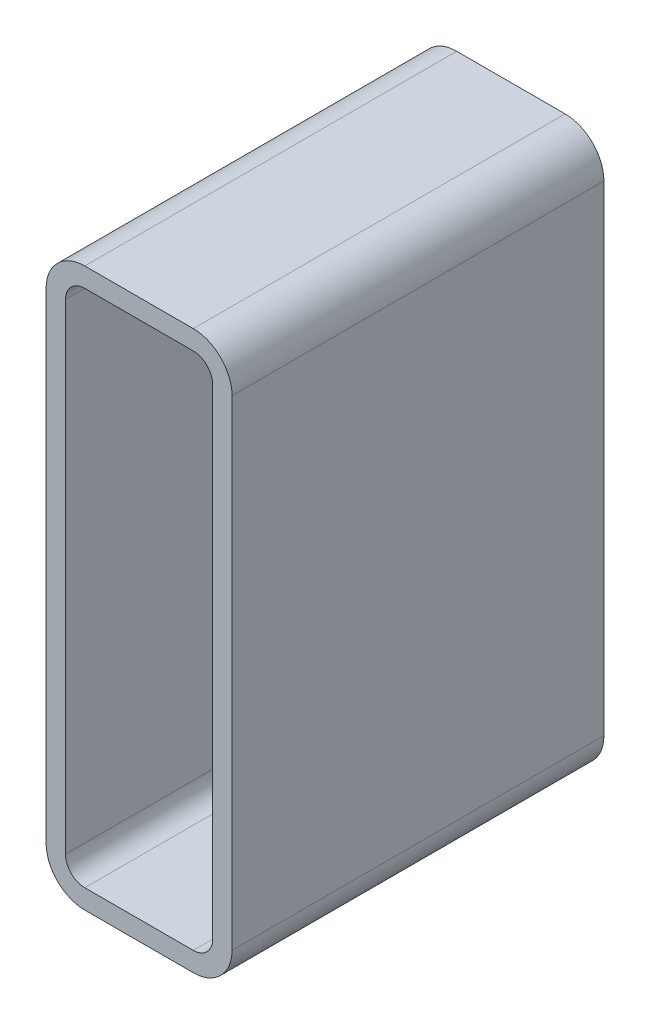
ISO-10303-21;
HEADER;
FILE_DESCRIPTION(('STEP AP214'),'2;1');
FILE_NAME('part.step','',(''),(''),'','','');
FILE_SCHEMA(('AUTOMOTIVE_DESIGN { 1 0 10303 214 1 1 1 1 }'));
ENDSEC;
DATA;
#1=APPLICATION_CONTEXT('core data for automotive mechanical design processes');
#2=APPLICATION_PROTOCOL_DEFINITION('international standard','automotive_design',2000,#1);
#3=PRODUCT_CONTEXT('',#1,'mechanical');
#4=PRODUCT('Part','Part','',(#3));
#5=PRODUCT_RELATED_PRODUCT_CATEGORY('part','',(#4));
#6=PRODUCT_DEFINITION_FORMATION('','',#4);
#7=PRODUCT_DEFINITION_CONTEXT('part definition',#1,'design');
#8=PRODUCT_DEFINITION('design','',#6,#7);
#9=PRODUCT_DEFINITION_SHAPE('','',#8);
#10=(LENGTH_UNIT() NAMED_UNIT(*) SI_UNIT(.MILLI.,.METRE.));
#11=(NAMED_UNIT(*) PLANE_ANGLE_UNIT() SI_UNIT($,.RADIAN.));
#12=(NAMED_UNIT(*) SI_UNIT($,.STERADIAN.) SOLID_ANGLE_UNIT());
#13=UNCERTAINTY_MEASURE_WITH_UNIT(LENGTH_MEASURE(1.E-05),#10,'distance_accuracy_value','');
#14=(GEOMETRIC_REPRESENTATION_CONTEXT(3) GLOBAL_UNCERTAINTY_ASSIGNED_CONTEXT((#13)) GLOBAL_UNIT_ASSIGNED_CONTEXT((#10,
#11,#12)) REPRESENTATION_CONTEXT('',''));
#15=CARTESIAN_POINT('',(0.,0.,0.));
#16=DIRECTION('',(0.,0.,1.));
#17=DIRECTION('',(1.,0.,0.));
#18=AXIS2_PLACEMENT_3D('',#15,#16,#17);
#19=CARTESIAN_POINT('',(31.7973013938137,427.187045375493,304.8));
#20=DIRECTION('',(0.,0.,1.));
#21=DIRECTION('',(1.,0.,0.));
#22=AXIS2_PLACEMENT_3D('',#19,#20,#21);
#23=PLANE('',#22);
#24=CARTESIAN_POINT('',(31.7973013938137,427.187045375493,304.8));
#25=DIRECTION('',(0.,0.,1.));
#26=DIRECTION('',(1.,0.,0.));
#27=AXIS2_PLACEMENT_3D('',#24,#25,#26);
#28=CIRCLE('',#27,31.75);
#29=CARTESIAN_POINT('',(31.7973013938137,458.937045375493,304.8));
#30=VERTEX_POINT('',#29);
#31=CARTESIAN_POINT('',(0.0473013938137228,427.187045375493,304.8));
#32=VERTEX_POINT('',#31);
#33=EDGE_CURVE('E211',#30,#32,#28,.T.);
#34=ORIENTED_EDGE('',*,*,#33,.T.);
#35=DIRECTION('',(0.,-1.,0.));
#36=VECTOR('',#35,1.);
#37=CARTESIAN_POINT('',(0.0473013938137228,427.187045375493,304.8));
#38=LINE('',#37,#36);
#39=CARTESIAN_POINT('',(0.0473013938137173,33.4870453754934,304.8));
#40=VERTEX_POINT('',#39);
#41=EDGE_CURVE('E214',#32,#40,#38,.T.);
#42=ORIENTED_EDGE('',*,*,#41,.T.);
#43=CARTESIAN_POINT('',(31.7973013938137,33.4870453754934,304.8));
#44=DIRECTION('',(0.,0.,1.));
#45=DIRECTION('',(1.,0.,0.));
#46=AXIS2_PLACEMENT_3D('',#43,#44,#45);
#47=CIRCLE('',#46,31.75);
#48=CARTESIAN_POINT('',(31.7973013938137,1.73704537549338,304.8));
#49=VERTEX_POINT('',#48);
#50=EDGE_CURVE('E217',#40,#49,#47,.T.);
#51=ORIENTED_EDGE('',*,*,#50,.T.);
#52=DIRECTION('',(1.,0.,0.));
#53=VECTOR('',#52,1.);
#54=CARTESIAN_POINT('',(31.7973013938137,1.73704537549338,304.8));
#55=LINE('',#54,#53);
#56=CARTESIAN_POINT('',(120.697301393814,1.73704537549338,304.8));
#57=VERTEX_POINT('',#56);
#58=EDGE_CURVE('E219',#49,#57,#55,.T.);
#59=ORIENTED_EDGE('',*,*,#58,.T.);
#60=CARTESIAN_POINT('',(120.697301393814,33.4870453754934,304.8));
#61=DIRECTION('',(0.,0.,1.));
#62=DIRECTION('',(1.,0.,0.));
#63=AXIS2_PLACEMENT_3D('',#60,#61,#62);
#64=CIRCLE('',#63,31.75);
#65=CARTESIAN_POINT('',(152.447301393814,33.4870453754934,304.8));
#66=VERTEX_POINT('',#65);
#67=EDGE_CURVE('E221',#57,#66,#64,.T.);
#68=ORIENTED_EDGE('',*,*,#67,.T.);
#69=DIRECTION('',(0.,1.,0.));
#70=VECTOR('',#69,1.);
#71=CARTESIAN_POINT('',(152.447301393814,33.4870453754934,304.8));
#72=LINE('',#71,#70);
#73=CARTESIAN_POINT('',(152.447301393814,427.187045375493,304.8));
#74=VERTEX_POINT('',#73);
#75=EDGE_CURVE('E223',#66,#74,#72,.T.);
#76=ORIENTED_EDGE('',*,*,#75,.T.);
#77=CARTESIAN_POINT('',(120.697301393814,427.187045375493,304.8));
#78=DIRECTION('',(0.,0.,1.));
#79=DIRECTION('',(1.,0.,0.));
#80=AXIS2_PLACEMENT_3D('',#77,#78,#79);
#81=CIRCLE('',#80,31.75);
#82=CARTESIAN_POINT('',(120.697301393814,458.937045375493,304.8));
#83=VERTEX_POINT('',#82);
#84=EDGE_CURVE('E225',#74,#83,#81,.T.);
#85=ORIENTED_EDGE('',*,*,#84,.T.);
#86=DIRECTION('',(-1.,0.,0.));
#87=VECTOR('',#86,1.);
#88=CARTESIAN_POINT('',(120.697301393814,458.937045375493,304.8));
#89=LINE('',#88,#87);
#90=EDGE_CURVE('E227',#83,#30,#89,.T.);
#91=ORIENTED_EDGE('',*,*,#90,.T.);
#92=EDGE_LOOP('',(#34,#42,#51,#59,#68,#76,#85,#91));
#93=FACE_BOUND('',#92,.T.);
#94=DIRECTION('',(0.,-1.,0.));
#95=VECTOR('',#94,1.);
#96=CARTESIAN_POINT('',(15.9223013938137,33.4870453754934,304.8));
#97=LINE('',#96,#95);
#98=CARTESIAN_POINT('',(15.9223013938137,427.187045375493,304.8));
#99=VERTEX_POINT('',#98);
#100=CARTESIAN_POINT('',(15.9223013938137,33.4870453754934,304.8));
#101=VERTEX_POINT('',#100);
#102=EDGE_CURVE('E154',#99,#101,#97,.T.);
#103=ORIENTED_EDGE('',*,*,#102,.F.);
#104=CARTESIAN_POINT('',(31.7973013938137,427.187045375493,304.8));
#105=DIRECTION('',(0.,0.,1.));
#106=DIRECTION('',(1.,0.,0.));
#107=AXIS2_PLACEMENT_3D('',#104,#105,#106);
#108=CIRCLE('',#107,15.875);
#109=CARTESIAN_POINT('',(31.7973013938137,443.062045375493,304.8));
#110=VERTEX_POINT('',#109);
#111=EDGE_CURVE('E146',#110,#99,#108,.T.);
#112=ORIENTED_EDGE('',*,*,#111,.F.);
#113=DIRECTION('',(-1.,0.,0.));
#114=VECTOR('',#113,1.);
#115=CARTESIAN_POINT('',(31.7973013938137,443.062045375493,304.8));
#116=LINE('',#115,#114);
#117=CARTESIAN_POINT('',(120.697301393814,443.062045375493,304.8));
#118=VERTEX_POINT('',#117);
#119=EDGE_CURVE('E179',#118,#110,#116,.T.);
#120=ORIENTED_EDGE('',*,*,#119,.F.);
#121=CARTESIAN_POINT('',(120.697301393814,427.187045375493,304.8));
#122=DIRECTION('',(0.,0.,1.));
#123=DIRECTION('',(1.,0.,0.));
#124=AXIS2_PLACEMENT_3D('',#121,#122,#123);
#125=CIRCLE('',#124,15.875);
#126=CARTESIAN_POINT('',(136.572301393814,427.187045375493,304.8));
#127=VERTEX_POINT('',#126);
#128=EDGE_CURVE('E177',#127,#118,#125,.T.);
#129=ORIENTED_EDGE('',*,*,#128,.F.);
#130=DIRECTION('',(0.,1.,0.));
#131=VECTOR('',#130,1.);
#132=CARTESIAN_POINT('',(136.572301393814,427.187045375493,304.8));
#133=LINE('',#132,#131);
#134=CARTESIAN_POINT('',(136.572301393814,33.4870453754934,304.8));
#135=VERTEX_POINT('',#134);
#136=EDGE_CURVE('E175',#135,#127,#133,.T.);
#137=ORIENTED_EDGE('',*,*,#136,.F.);
#138=CARTESIAN_POINT('',(120.697301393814,33.4870453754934,304.8));
#139=DIRECTION('',(0.,0.,1.));
#140=DIRECTION('',(1.,0.,0.));
#141=AXIS2_PLACEMENT_3D('',#138,#139,#140);
#142=CIRCLE('',#141,15.875);
#143=CARTESIAN_POINT('',(120.697301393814,17.6120453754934,304.8));
#144=VERTEX_POINT('',#143);
#145=EDGE_CURVE('E173',#144,#135,#142,.T.);
#146=ORIENTED_EDGE('',*,*,#145,.F.);
#147=DIRECTION('',(1.,0.,0.));
#148=VECTOR('',#147,1.);
#149=CARTESIAN_POINT('',(120.697301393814,17.6120453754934,304.8));
#150=LINE('',#149,#148);
#151=CARTESIAN_POINT('',(31.7973013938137,17.6120453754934,304.8));
#152=VERTEX_POINT('',#151);
#153=EDGE_CURVE('E169',#152,#144,#150,.T.);
#154=ORIENTED_EDGE('',*,*,#153,.F.);
#155=CARTESIAN_POINT('',(31.7973013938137,33.4870453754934,304.8));
#156=DIRECTION('',(0.,0.,1.));
#157=DIRECTION('',(1.,0.,0.));
#158=AXIS2_PLACEMENT_3D('',#155,#156,#157);
#159=CIRCLE('',#158,15.875);
#160=EDGE_CURVE('E167',#101,#152,#159,.T.);
#161=ORIENTED_EDGE('',*,*,#160,.F.);
#162=EDGE_LOOP('',(#103,#112,#120,#129,#137,#146,#154,#161));
#163=FACE_BOUND('',#162,.T.);
#164=ADVANCED_FACE('F33',(#93,#163),#23,.T.);
#165=CARTESIAN_POINT('',(31.7973013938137,427.187045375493,0.));
#166=DIRECTION('',(0.,0.,1.));
#167=DIRECTION('',(1.,0.,0.));
#168=AXIS2_PLACEMENT_3D('',#165,#166,#167);
#169=PLANE('',#168);
#170=CARTESIAN_POINT('',(31.7973013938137,427.187045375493,0.));
#171=DIRECTION('',(0.,0.,1.));
#172=DIRECTION('',(1.,0.,0.));
#173=AXIS2_PLACEMENT_3D('',#170,#171,#172);
#174=CIRCLE('',#173,31.75);
#175=CARTESIAN_POINT('',(31.7973013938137,458.937045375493,0.));
#176=VERTEX_POINT('',#175);
#177=CARTESIAN_POINT('',(0.0473013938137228,427.187045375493,0.));
#178=VERTEX_POINT('',#177);
#179=EDGE_CURVE('E162',#176,#178,#174,.T.);
#180=ORIENTED_EDGE('',*,*,#179,.F.);
#181=DIRECTION('',(-1.,0.,0.));
#182=VECTOR('',#181,1.);
#183=CARTESIAN_POINT('',(120.697301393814,458.937045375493,0.));
#184=LINE('',#183,#182);
#185=CARTESIAN_POINT('',(120.697301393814,458.937045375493,0.));
#186=VERTEX_POINT('',#185);
#187=EDGE_CURVE('E215',#186,#176,#184,.T.);
#188=ORIENTED_EDGE('',*,*,#187,.F.);
#189=CARTESIAN_POINT('',(120.697301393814,427.187045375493,0.));
#190=DIRECTION('',(0.,0.,1.));
#191=DIRECTION('',(1.,0.,0.));
#192=AXIS2_PLACEMENT_3D('',#189,#190,#191);
#193=CIRCLE('',#192,31.75);
#194=CARTESIAN_POINT('',(152.447301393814,427.187045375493,0.));
#195=VERTEX_POINT('',#194);
#196=EDGE_CURVE('E242',#195,#186,#193,.T.);
#197=ORIENTED_EDGE('',*,*,#196,.F.);
#198=DIRECTION('',(0.,1.,0.));
#199=VECTOR('',#198,1.);
#200=CARTESIAN_POINT('',(152.447301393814,33.4870453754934,0.));
#201=LINE('',#200,#199);
#202=CARTESIAN_POINT('',(152.447301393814,33.4870453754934,0.));
#203=VERTEX_POINT('',#202);
#204=EDGE_CURVE('E240',#203,#195,#201,.T.);
#205=ORIENTED_EDGE('',*,*,#204,.F.);
#206=CARTESIAN_POINT('',(120.697301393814,33.4870453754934,0.));
#207=DIRECTION('',(0.,0.,1.));
#208=DIRECTION('',(1.,0.,0.));
#209=AXIS2_PLACEMENT_3D('',#206,#207,#208);
#210=CIRCLE('',#209,31.75);
#211=CARTESIAN_POINT('',(120.697301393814,1.73704537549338,0.));
#212=VERTEX_POINT('',#211);
#213=EDGE_CURVE('E238',#212,#203,#210,.T.);
#214=ORIENTED_EDGE('',*,*,#213,.F.);
#215=DIRECTION('',(1.,0.,0.));
#216=VECTOR('',#215,1.);
#217=CARTESIAN_POINT('',(31.7973013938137,1.73704537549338,0.));
#218=LINE('',#217,#216);
#219=CARTESIAN_POINT('',(31.7973013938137,1.73704537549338,0.));
#220=VERTEX_POINT('',#219);
#221=EDGE_CURVE('E236',#220,#212,#218,.T.);
#222=ORIENTED_EDGE('',*,*,#221,.F.);
#223=CARTESIAN_POINT('',(31.7973013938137,33.4870453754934,0.));
#224=DIRECTION('',(0.,0.,1.));
#225=DIRECTION('',(1.,0.,0.));
#226=AXIS2_PLACEMENT_3D('',#223,#224,#225);
#227=CIRCLE('',#226,31.75);
#228=CARTESIAN_POINT('',(0.0473013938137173,33.4870453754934,0.));
#229=VERTEX_POINT('',#228);
#230=EDGE_CURVE('E234',#229,#220,#227,.T.);
#231=ORIENTED_EDGE('',*,*,#230,.F.);
#232=DIRECTION('',(0.,-1.,0.));
#233=VECTOR('',#232,1.);
#234=CARTESIAN_POINT('',(0.0473013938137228,427.187045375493,0.));
#235=LINE('',#234,#233);
#236=EDGE_CURVE('E232',#178,#229,#235,.T.);
#237=ORIENTED_EDGE('',*,*,#236,.F.);
#238=EDGE_LOOP('',(#180,#188,#197,#205,#214,#222,#231,#237));
#239=FACE_BOUND('',#238,.T.);
#240=CARTESIAN_POINT('',(31.7973013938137,427.187045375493,0.));
#241=DIRECTION('',(0.,0.,1.));
#242=DIRECTION('',(1.,0.,0.));
#243=AXIS2_PLACEMENT_3D('',#240,#241,#242);
#244=CIRCLE('',#243,15.875);
#245=CARTESIAN_POINT('',(31.7973013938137,443.062045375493,0.));
#246=VERTEX_POINT('',#245);
#247=CARTESIAN_POINT('',(15.9223013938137,427.187045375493,0.));
#248=VERTEX_POINT('',#247);
#249=EDGE_CURVE('E56',#246,#248,#244,.T.);
#250=ORIENTED_EDGE('',*,*,#249,.T.);
#251=DIRECTION('',(0.,-1.,0.));
#252=VECTOR('',#251,1.);
#253=CARTESIAN_POINT('',(15.9223013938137,33.4870453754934,0.));
#254=LINE('',#253,#252);
#255=CARTESIAN_POINT('',(15.9223013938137,33.4870453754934,0.));
#256=VERTEX_POINT('',#255);
#257=EDGE_CURVE('E161',#248,#256,#254,.T.);
#258=ORIENTED_EDGE('',*,*,#257,.T.);
#259=CARTESIAN_POINT('',(31.7973013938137,33.4870453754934,0.));
#260=DIRECTION('',(0.,0.,1.));
#261=DIRECTION('',(1.,0.,0.));
#262=AXIS2_PLACEMENT_3D('',#259,#260,#261);
#263=CIRCLE('',#262,15.875);
#264=CARTESIAN_POINT('',(31.7973013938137,17.6120453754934,0.));
#265=VERTEX_POINT('',#264);
#266=EDGE_CURVE('E183',#256,#265,#263,.T.);
#267=ORIENTED_EDGE('',*,*,#266,.T.);
#268=DIRECTION('',(1.,0.,0.));
#269=VECTOR('',#268,1.);
#270=CARTESIAN_POINT('',(120.697301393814,17.6120453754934,0.));
#271=LINE('',#270,#269);
#272=CARTESIAN_POINT('',(120.697301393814,17.6120453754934,0.));
#273=VERTEX_POINT('',#272);
#274=EDGE_CURVE('E186',#265,#273,#271,.T.);
#275=ORIENTED_EDGE('',*,*,#274,.T.);
#276=CARTESIAN_POINT('',(120.697301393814,33.4870453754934,0.));
#277=DIRECTION('',(0.,0.,1.));
#278=DIRECTION('',(1.,0.,0.));
#279=AXIS2_PLACEMENT_3D('',#276,#277,#278);
#280=CIRCLE('',#279,15.875);
#281=CARTESIAN_POINT('',(136.572301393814,33.4870453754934,0.));
#282=VERTEX_POINT('',#281);
#283=EDGE_CURVE('E189',#273,#282,#280,.T.);
#284=ORIENTED_EDGE('',*,*,#283,.T.);
#285=DIRECTION('',(0.,1.,0.));
#286=VECTOR('',#285,1.);
#287=CARTESIAN_POINT('',(136.572301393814,427.187045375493,0.));
#288=LINE('',#287,#286);
#289=CARTESIAN_POINT('',(136.572301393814,427.187045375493,0.));
#290=VERTEX_POINT('',#289);
#291=EDGE_CURVE('E192',#282,#290,#288,.T.);
#292=ORIENTED_EDGE('',*,*,#291,.T.);
#293=CARTESIAN_POINT('',(120.697301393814,427.187045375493,0.));
#294=DIRECTION('',(0.,0.,1.));
#295=DIRECTION('',(1.,0.,0.));
#296=AXIS2_PLACEMENT_3D('',#293,#294,#295);
#297=CIRCLE('',#296,15.875);
#298=CARTESIAN_POINT('',(120.697301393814,443.062045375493,0.));
#299=VERTEX_POINT('',#298);
#300=EDGE_CURVE('E195',#290,#299,#297,.T.);
#301=ORIENTED_EDGE('',*,*,#300,.T.);
#302=DIRECTION('',(-1.,0.,0.));
#303=VECTOR('',#302,1.);
#304=CARTESIAN_POINT('',(31.7973013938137,443.062045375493,0.));
#305=LINE('',#304,#303);
#306=EDGE_CURVE('E155',#299,#246,#305,.T.);
#307=ORIENTED_EDGE('',*,*,#306,.T.);
#308=EDGE_LOOP('',(#250,#258,#267,#275,#284,#292,#301,#307));
#309=FACE_BOUND('',#308,.T.);
#310=ADVANCED_FACE('F272',(#239,#309),#169,.F.);
#311=CARTESIAN_POINT('',(31.7973013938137,427.187045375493,304.8));
#312=DIRECTION('',(0.,0.,-1.));
#313=DIRECTION('',(-1.,0.,0.));
#314=AXIS2_PLACEMENT_3D('',#311,#312,#313);
#315=CYLINDRICAL_SURFACE('',#314,31.75);
#316=ORIENTED_EDGE('',*,*,#179,.T.);
#317=DIRECTION('',(0.,0.,-1.));
#318=VECTOR('',#317,1.);
#319=CARTESIAN_POINT('',(0.0473013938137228,427.187045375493,304.8));
#320=LINE('',#319,#318);
#321=EDGE_CURVE('E11',#32,#178,#320,.T.);
#322=ORIENTED_EDGE('',*,*,#321,.F.);
#323=ORIENTED_EDGE('',*,*,#33,.F.);
#324=DIRECTION('',(0.,0.,-1.));
#325=VECTOR('',#324,1.);
#326=CARTESIAN_POINT('',(31.7973013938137,458.937045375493,304.8));
#327=LINE('',#326,#325);
#328=EDGE_CURVE('E229',#30,#176,#327,.T.);
#329=ORIENTED_EDGE('',*,*,#328,.T.);
#330=EDGE_LOOP('',(#316,#322,#323,#329));
#331=FACE_BOUND('',#330,.T.);
#332=ADVANCED_FACE('F35',(#331),#315,.T.);
#333=CARTESIAN_POINT('',(0.0473013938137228,427.187045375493,304.8));
#334=DIRECTION('',(1.,0.,0.));
#335=DIRECTION('',(0.,0.,-1.));
#336=AXIS2_PLACEMENT_3D('',#333,#334,#335);
#337=PLANE('',#336);
#338=ORIENTED_EDGE('',*,*,#236,.T.);
#339=DIRECTION('',(0.,0.,-1.));
#340=VECTOR('',#339,1.);
#341=CARTESIAN_POINT('',(0.0473013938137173,33.4870453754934,304.8));
#342=LINE('',#341,#340);
#343=EDGE_CURVE('E41',#40,#229,#342,.T.);
#344=ORIENTED_EDGE('',*,*,#343,.F.);
#345=ORIENTED_EDGE('',*,*,#41,.F.);
#346=ORIENTED_EDGE('',*,*,#321,.T.);
#347=EDGE_LOOP('',(#338,#344,#345,#346));
#348=FACE_BOUND('',#347,.T.);
#349=ADVANCED_FACE('F289',(#348),#337,.F.);
#350=CARTESIAN_POINT('',(31.7973013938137,33.4870453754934,304.8));
#351=DIRECTION('',(0.,0.,-1.));
#352=DIRECTION('',(-1.,0.,0.));
#353=AXIS2_PLACEMENT_3D('',#350,#351,#352);
#354=CYLINDRICAL_SURFACE('',#353,31.75);
#355=ORIENTED_EDGE('',*,*,#230,.T.);
#356=DIRECTION('',(0.,0.,-1.));
#357=VECTOR('',#356,1.);
#358=CARTESIAN_POINT('',(31.7973013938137,1.73704537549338,304.8));
#359=LINE('',#358,#357);
#360=EDGE_CURVE('E259',#49,#220,#359,.T.);
#361=ORIENTED_EDGE('',*,*,#360,.F.);
#362=ORIENTED_EDGE('',*,*,#50,.F.);
#363=ORIENTED_EDGE('',*,*,#343,.T.);
#364=EDGE_LOOP('',(#355,#361,#362,#363));
#365=FACE_BOUND('',#364,.T.);
#366=ADVANCED_FACE('F266',(#365),#354,.T.);
#367=CARTESIAN_POINT('',(31.7973013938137,1.73704537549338,304.8));
#368=DIRECTION('',(0.,1.,0.));
#369=DIRECTION('',(0.,0.,1.));
#370=AXIS2_PLACEMENT_3D('',#367,#368,#369);
#371=PLANE('',#370);
#372=ORIENTED_EDGE('',*,*,#221,.T.);
#373=DIRECTION('',(0.,0.,-1.));
#374=VECTOR('',#373,1.);
#375=CARTESIAN_POINT('',(120.697301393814,1.73704537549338,304.8));
#376=LINE('',#375,#374);
#377=EDGE_CURVE('E256',#57,#212,#376,.T.);
#378=ORIENTED_EDGE('',*,*,#377,.F.);
#379=ORIENTED_EDGE('',*,*,#58,.F.);
#380=ORIENTED_EDGE('',*,*,#360,.T.);
#381=EDGE_LOOP('',(#372,#378,#379,#380));
#382=FACE_BOUND('',#381,.T.);
#383=ADVANCED_FACE('F278',(#382),#371,.F.);
#384=CARTESIAN_POINT('',(120.697301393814,33.4870453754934,304.8));
#385=DIRECTION('',(0.,0.,-1.));
#386=DIRECTION('',(-1.,0.,0.));
#387=AXIS2_PLACEMENT_3D('',#384,#385,#386);
#388=CYLINDRICAL_SURFACE('',#387,31.75);
#389=ORIENTED_EDGE('',*,*,#213,.T.);
#390=DIRECTION('',(0.,0.,-1.));
#391=VECTOR('',#390,1.);
#392=CARTESIAN_POINT('',(152.447301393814,33.4870453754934,304.8));
#393=LINE('',#392,#391);
#394=EDGE_CURVE('E253',#66,#203,#393,.T.);
#395=ORIENTED_EDGE('',*,*,#394,.F.);
#396=ORIENTED_EDGE('',*,*,#67,.F.);
#397=ORIENTED_EDGE('',*,*,#377,.T.);
#398=EDGE_LOOP('',(#389,#395,#396,#397));
#399=FACE_BOUND('',#398,.T.);
#400=ADVANCED_FACE('F282',(#399),#388,.T.);
#401=CARTESIAN_POINT('',(152.447301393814,33.4870453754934,304.8));
#402=DIRECTION('',(-1.,0.,0.));
#403=DIRECTION('',(0.,0.,1.));
#404=AXIS2_PLACEMENT_3D('',#401,#402,#403);
#405=PLANE('',#404);
#406=ORIENTED_EDGE('',*,*,#204,.T.);
#407=DIRECTION('',(0.,0.,-1.));
#408=VECTOR('',#407,1.);
#409=CARTESIAN_POINT('',(152.447301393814,427.187045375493,304.8));
#410=LINE('',#409,#408);
#411=EDGE_CURVE('E250',#74,#195,#410,.T.);
#412=ORIENTED_EDGE('',*,*,#411,.F.);
#413=ORIENTED_EDGE('',*,*,#75,.F.);
#414=ORIENTED_EDGE('',*,*,#394,.T.);
#415=EDGE_LOOP('',(#406,#412,#413,#414));
#416=FACE_BOUND('',#415,.T.);
#417=ADVANCED_FACE('F302',(#416),#405,.F.);
#418=CARTESIAN_POINT('',(120.697301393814,427.187045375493,304.8));
#419=DIRECTION('',(0.,0.,-1.));
#420=DIRECTION('',(-1.,0.,0.));
#421=AXIS2_PLACEMENT_3D('',#418,#419,#420);
#422=CYLINDRICAL_SURFACE('',#421,31.75);
#423=ORIENTED_EDGE('',*,*,#196,.T.);
#424=DIRECTION('',(0.,0.,-1.));
#425=VECTOR('',#424,1.);
#426=CARTESIAN_POINT('',(120.697301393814,458.937045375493,304.8));
#427=LINE('',#426,#425);
#428=EDGE_CURVE('E247',#83,#186,#427,.T.);
#429=ORIENTED_EDGE('',*,*,#428,.F.);
#430=ORIENTED_EDGE('',*,*,#84,.F.);
#431=ORIENTED_EDGE('',*,*,#411,.T.);
#432=EDGE_LOOP('',(#423,#429,#430,#431));
#433=FACE_BOUND('',#432,.T.);
#434=ADVANCED_FACE('F300',(#433),#422,.T.);
#435=CARTESIAN_POINT('',(120.697301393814,458.937045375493,304.8));
#436=DIRECTION('',(0.,-1.,0.));
#437=DIRECTION('',(0.,0.,-1.));
#438=AXIS2_PLACEMENT_3D('',#435,#436,#437);
#439=PLANE('',#438);
#440=ORIENTED_EDGE('',*,*,#187,.T.);
#441=ORIENTED_EDGE('',*,*,#328,.F.);
#442=ORIENTED_EDGE('',*,*,#90,.F.);
#443=ORIENTED_EDGE('',*,*,#428,.T.);
#444=EDGE_LOOP('',(#440,#441,#442,#443));
#445=FACE_BOUND('',#444,.T.);
#446=ADVANCED_FACE('F295',(#445),#439,.F.);
#447=CARTESIAN_POINT('',(31.7973013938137,427.187045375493,304.8));
#448=DIRECTION('',(0.,0.,-1.));
#449=DIRECTION('',(-1.,0.,0.));
#450=AXIS2_PLACEMENT_3D('',#447,#448,#449);
#451=CYLINDRICAL_SURFACE('',#450,15.875);
#452=ORIENTED_EDGE('',*,*,#249,.F.);
#453=DIRECTION('',(0.,0.,-1.));
#454=VECTOR('',#453,1.);
#455=CARTESIAN_POINT('',(31.7973013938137,443.062045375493,304.8));
#456=LINE('',#455,#454);
#457=EDGE_CURVE('E150',#110,#246,#456,.T.);
#458=ORIENTED_EDGE('',*,*,#457,.F.);
#459=ORIENTED_EDGE('',*,*,#111,.T.);
#460=DIRECTION('',(0.,0.,-1.));
#461=VECTOR('',#460,1.);
#462=CARTESIAN_POINT('',(15.9223013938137,427.187045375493,304.8));
#463=LINE('',#462,#461);
#464=EDGE_CURVE('E149',#99,#248,#463,.T.);
#465=ORIENTED_EDGE('',*,*,#464,.T.);
#466=EDGE_LOOP('',(#452,#458,#459,#465));
#467=FACE_BOUND('',#466,.T.);
#468=ADVANCED_FACE('F148',(#467),#451,.F.);
#469=CARTESIAN_POINT('',(15.9223013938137,33.4870453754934,304.8));
#470=DIRECTION('',(1.,0.,0.));
#471=DIRECTION('',(0.,0.,-1.));
#472=AXIS2_PLACEMENT_3D('',#469,#470,#471);
#473=PLANE('',#472);
#474=ORIENTED_EDGE('',*,*,#257,.F.);
#475=ORIENTED_EDGE('',*,*,#464,.F.);
#476=ORIENTED_EDGE('',*,*,#102,.T.);
#477=DIRECTION('',(0.,0.,-1.));
#478=VECTOR('',#477,1.);
#479=CARTESIAN_POINT('',(15.9223013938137,33.4870453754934,304.8));
#480=LINE('',#479,#478);
#481=EDGE_CURVE('E163',#101,#256,#480,.T.);
#482=ORIENTED_EDGE('',*,*,#481,.T.);
#483=EDGE_LOOP('',(#474,#475,#476,#482));
#484=FACE_BOUND('',#483,.T.);
#485=ADVANCED_FACE('F158',(#484),#473,.T.);
#486=CARTESIAN_POINT('',(31.7973013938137,33.4870453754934,304.8));
#487=DIRECTION('',(0.,0.,-1.));
#488=DIRECTION('',(-1.,0.,0.));
#489=AXIS2_PLACEMENT_3D('',#486,#487,#488);
#490=CYLINDRICAL_SURFACE('',#489,15.875);
#491=ORIENTED_EDGE('',*,*,#266,.F.);
#492=ORIENTED_EDGE('',*,*,#481,.F.);
#493=ORIENTED_EDGE('',*,*,#160,.T.);
#494=DIRECTION('',(0.,0.,-1.));
#495=VECTOR('',#494,1.);
#496=CARTESIAN_POINT('',(31.7973013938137,17.6120453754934,304.8));
#497=LINE('',#496,#495);
#498=EDGE_CURVE('E208',#152,#265,#497,.T.);
#499=ORIENTED_EDGE('',*,*,#498,.T.);
#500=EDGE_LOOP('',(#491,#492,#493,#499));
#501=FACE_BOUND('',#500,.T.);
#502=ADVANCED_FACE('F327',(#501),#490,.F.);
#503=CARTESIAN_POINT('',(120.697301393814,17.6120453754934,304.8));
#504=DIRECTION('',(0.,1.,0.));
#505=DIRECTION('',(0.,0.,1.));
#506=AXIS2_PLACEMENT_3D('',#503,#504,#505);
#507=PLANE('',#506);
#508=ORIENTED_EDGE('',*,*,#274,.F.);
#509=ORIENTED_EDGE('',*,*,#498,.F.);
#510=ORIENTED_EDGE('',*,*,#153,.T.);
#511=DIRECTION('',(0.,0.,-1.));
#512=VECTOR('',#511,1.);
#513=CARTESIAN_POINT('',(120.697301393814,17.6120453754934,304.8));
#514=LINE('',#513,#512);
#515=EDGE_CURVE('E206',#144,#273,#514,.T.);
#516=ORIENTED_EDGE('',*,*,#515,.T.);
#517=EDGE_LOOP('',(#508,#509,#510,#516));
#518=FACE_BOUND('',#517,.T.);
#519=ADVANCED_FACE('F331',(#518),#507,.T.);
#520=CARTESIAN_POINT('',(120.697301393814,33.4870453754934,304.8));
#521=DIRECTION('',(0.,0.,-1.));
#522=DIRECTION('',(-1.,0.,0.));
#523=AXIS2_PLACEMENT_3D('',#520,#521,#522);
#524=CYLINDRICAL_SURFACE('',#523,15.875);
#525=ORIENTED_EDGE('',*,*,#283,.F.);
#526=ORIENTED_EDGE('',*,*,#515,.F.);
#527=ORIENTED_EDGE('',*,*,#145,.T.);
#528=DIRECTION('',(0.,0.,-1.));
#529=VECTOR('',#528,1.);
#530=CARTESIAN_POINT('',(136.572301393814,33.4870453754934,304.8));
#531=LINE('',#530,#529);
#532=EDGE_CURVE('E204',#135,#282,#531,.T.);
#533=ORIENTED_EDGE('',*,*,#532,.T.);
#534=EDGE_LOOP('',(#525,#526,#527,#533));
#535=FACE_BOUND('',#534,.T.);
#536=ADVANCED_FACE('F337',(#535),#524,.F.);
#537=CARTESIAN_POINT('',(136.572301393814,427.187045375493,304.8));
#538=DIRECTION('',(-1.,0.,0.));
#539=DIRECTION('',(0.,0.,1.));
#540=AXIS2_PLACEMENT_3D('',#537,#538,#539);
#541=PLANE('',#540);
#542=ORIENTED_EDGE('',*,*,#291,.F.);
#543=ORIENTED_EDGE('',*,*,#532,.F.);
#544=ORIENTED_EDGE('',*,*,#136,.T.);
#545=DIRECTION('',(0.,0.,-1.));
#546=VECTOR('',#545,1.);
#547=CARTESIAN_POINT('',(136.572301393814,427.187045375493,304.8));
#548=LINE('',#547,#546);
#549=EDGE_CURVE('E202',#127,#290,#548,.T.);
#550=ORIENTED_EDGE('',*,*,#549,.T.);
#551=EDGE_LOOP('',(#542,#543,#544,#550));
#552=FACE_BOUND('',#551,.T.);
#553=ADVANCED_FACE('F341',(#552),#541,.T.);
#554=CARTESIAN_POINT('',(120.697301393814,427.187045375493,304.8));
#555=DIRECTION('',(0.,0.,-1.));
#556=DIRECTION('',(-1.,0.,0.));
#557=AXIS2_PLACEMENT_3D('',#554,#555,#556);
#558=CYLINDRICAL_SURFACE('',#557,15.875);
#559=ORIENTED_EDGE('',*,*,#300,.F.);
#560=ORIENTED_EDGE('',*,*,#549,.F.);
#561=ORIENTED_EDGE('',*,*,#128,.T.);
#562=DIRECTION('',(0.,0.,-1.));
#563=VECTOR('',#562,1.);
#564=CARTESIAN_POINT('',(120.697301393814,443.062045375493,304.8));
#565=LINE('',#564,#563);
#566=EDGE_CURVE('E48',#118,#299,#565,.T.);
#567=ORIENTED_EDGE('',*,*,#566,.T.);
#568=EDGE_LOOP('',(#559,#560,#561,#567));
#569=FACE_BOUND('',#568,.T.);
#570=ADVANCED_FACE('F345',(#569),#558,.F.);
#571=CARTESIAN_POINT('',(31.7973013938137,443.062045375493,304.8));
#572=DIRECTION('',(0.,-1.,0.));
#573=DIRECTION('',(0.,0.,-1.));
#574=AXIS2_PLACEMENT_3D('',#571,#572,#573);
#575=PLANE('',#574);
#576=ORIENTED_EDGE('',*,*,#306,.F.);
#577=ORIENTED_EDGE('',*,*,#566,.F.);
#578=ORIENTED_EDGE('',*,*,#119,.T.);
#579=ORIENTED_EDGE('',*,*,#457,.T.);
#580=EDGE_LOOP('',(#576,#577,#578,#579));
#581=FACE_BOUND('',#580,.T.);
#582=ADVANCED_FACE('F349',(#581),#575,.T.);
#583=CLOSED_SHELL('',(#164,#310,#332,#349,#366,#383,#400,#417,#434,#446,#468,#485,#502,#519,
#536,#553,#570,#582));
#584=MANIFOLD_SOLID_BREP('B2',#583);
#585=ADVANCED_BREP_SHAPE_REPRESENTATION('',(#18,#584),#14);
#586=SHAPE_DEFINITION_REPRESENTATION(#9,#585);
ENDSEC;
END-ISO-10303-21;
